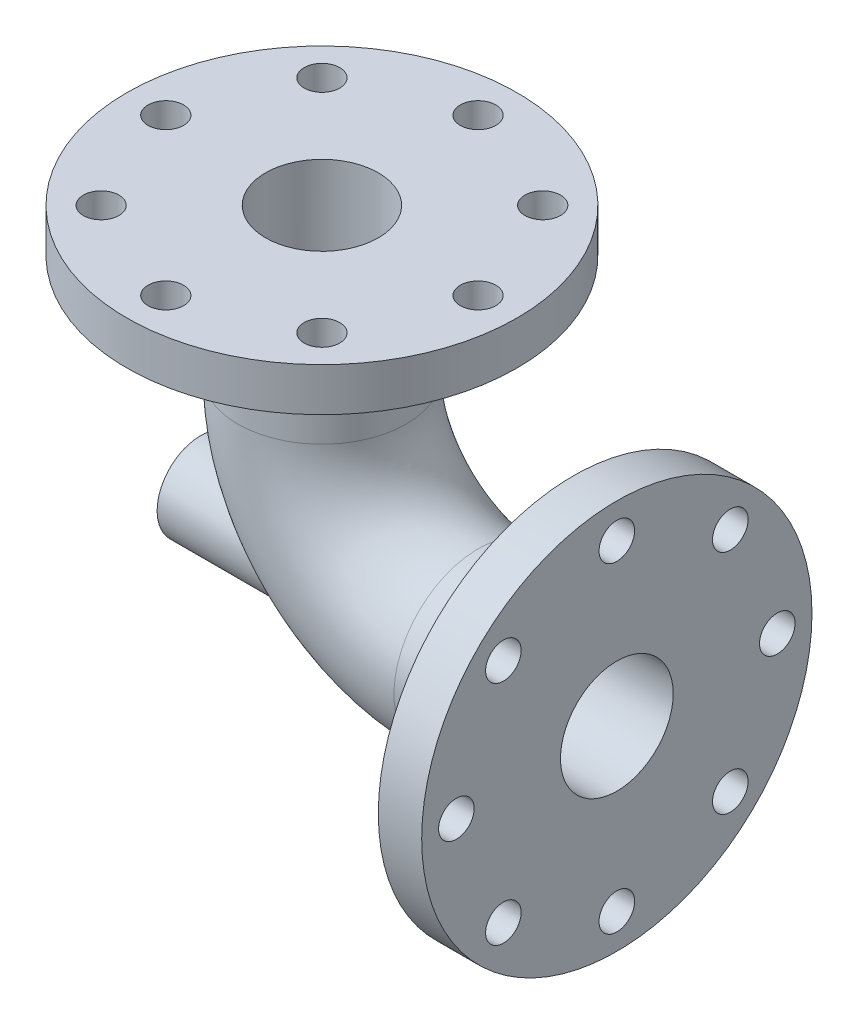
ISO-10303-21;
HEADER;
FILE_DESCRIPTION(('STEP AP214'),'2;1');
FILE_NAME('part.step','',(''),(''),'','','');
FILE_SCHEMA(('AUTOMOTIVE_DESIGN { 1 0 10303 214 1 1 1 1 }'));
ENDSEC;
DATA;
#1=APPLICATION_CONTEXT('core data for automotive mechanical design processes');
#2=APPLICATION_PROTOCOL_DEFINITION('international standard','automotive_design',2000,#1);
#3=PRODUCT_CONTEXT('',#1,'mechanical');
#4=PRODUCT('Part','Part','',(#3));
#5=PRODUCT_RELATED_PRODUCT_CATEGORY('part','',(#4));
#6=PRODUCT_DEFINITION_FORMATION('','',#4);
#7=PRODUCT_DEFINITION_CONTEXT('part definition',#1,'design');
#8=PRODUCT_DEFINITION('design','',#6,#7);
#9=PRODUCT_DEFINITION_SHAPE('','',#8);
#10=(LENGTH_UNIT() NAMED_UNIT(*) SI_UNIT(.MILLI.,.METRE.));
#11=(NAMED_UNIT(*) PLANE_ANGLE_UNIT() SI_UNIT($,.RADIAN.));
#12=(NAMED_UNIT(*) SI_UNIT($,.STERADIAN.) SOLID_ANGLE_UNIT());
#13=UNCERTAINTY_MEASURE_WITH_UNIT(LENGTH_MEASURE(1.E-05),#10,'distance_accuracy_value','');
#14=(GEOMETRIC_REPRESENTATION_CONTEXT(3) GLOBAL_UNCERTAINTY_ASSIGNED_CONTEXT((#13)) GLOBAL_UNIT_ASSIGNED_CONTEXT((#10,
#11,#12)) REPRESENTATION_CONTEXT('',''));
#15=CARTESIAN_POINT('',(0.,0.,0.));
#16=DIRECTION('',(0.,0.,1.));
#17=DIRECTION('',(1.,0.,0.));
#18=AXIS2_PLACEMENT_3D('',#15,#16,#17);
#19=CARTESIAN_POINT('',(0.,0.,0.));
#20=DIRECTION('',(0.,0.,-1.));
#21=DIRECTION('',(-1.,0.,0.));
#22=AXIS2_PLACEMENT_3D('',#19,#20,#21);
#23=TOROIDAL_SURFACE('',#22,90.,48.5);
#24=CARTESIAN_POINT('',(-90.,0.,0.));
#25=DIRECTION('',(0.,-1.,0.));
#26=DIRECTION('',(0.,0.,-1.));
#27=AXIS2_PLACEMENT_3D('',#24,#25,#26);
#28=CIRCLE('',#27,48.5);
#29=CARTESIAN_POINT('',(-90.,0.,-48.5));
#30=VERTEX_POINT('',#29);
#31=EDGE_CURVE('E44',#30,#30,#28,.T.);
#32=ORIENTED_EDGE('',*,*,#31,.T.);
#33=EDGE_LOOP('',(#32));
#34=FACE_BOUND('',#33,.T.);
#35=CARTESIAN_POINT('',(0.,-90.,0.));
#36=DIRECTION('',(1.,0.,0.));
#37=DIRECTION('',(0.,0.,-1.));
#38=AXIS2_PLACEMENT_3D('',#35,#36,#37);
#39=CIRCLE('',#38,48.5);
#40=CARTESIAN_POINT('',(0.,-90.,-48.5));
#41=VERTEX_POINT('',#40);
#42=EDGE_CURVE('E48',#41,#41,#39,.T.);
#43=ORIENTED_EDGE('',*,*,#42,.F.);
#44=EDGE_LOOP('',(#43));
#45=FACE_BOUND('',#44,.T.);
#46=CARTESIAN_POINT('',(-89.8449299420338,-96.875919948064,-24.035842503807));
#47=CARTESIAN_POINT('',(-89.2825330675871,-97.5468685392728,-23.8439036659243));
#48=CARTESIAN_POINT('',(-88.7304253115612,-98.2179177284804,-23.621553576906));
#49=CARTESIAN_POINT('',(-87.6507002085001,-99.5556563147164,-23.1128027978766));
#50=CARTESIAN_POINT('',(-87.1230864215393,-100.222345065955,-22.8263928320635));
#51=CARTESIAN_POINT('',(-86.0965582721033,-101.545396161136,-22.186554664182));
#52=CARTESIAN_POINT('',(-85.5976305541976,-102.201763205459,-21.8331579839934));
#53=CARTESIAN_POINT('',(-84.8738989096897,-103.173123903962,-21.2511488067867));
#54=CARTESIAN_POINT('',(-84.6367783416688,-103.494693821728,-21.048506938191));
#55=CARTESIAN_POINT('',(-84.1711191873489,-104.132603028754,-20.6256153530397));
#56=CARTESIAN_POINT('',(-83.9425828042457,-104.448940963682,-20.4053611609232));
#57=CARTESIAN_POINT('',(-83.3555767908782,-105.269697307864,-19.804842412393));
#58=CARTESIAN_POINT('',(-83.0045200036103,-105.768962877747,-19.4101271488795));
#59=CARTESIAN_POINT('',(-82.328599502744,-106.745583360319,-18.5741364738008));
#60=CARTESIAN_POINT('',(-82.0037307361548,-107.222942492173,-18.1328700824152));
#61=CARTESIAN_POINT('',(-81.3820615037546,-108.150413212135,-17.2044431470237));
#62=CARTESIAN_POINT('',(-81.0852548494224,-108.600530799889,-16.7172927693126));
#63=CARTESIAN_POINT('',(-80.5213707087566,-109.468010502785,-15.6985392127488));
#64=CARTESIAN_POINT('',(-80.2542937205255,-109.885372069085,-15.1669352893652));
#65=CARTESIAN_POINT('',(-79.7498574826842,-110.684098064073,-14.0583638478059));
#66=CARTESIAN_POINT('',(-79.5126893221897,-111.065227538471,-13.4811395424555));
#67=CARTESIAN_POINT('',(-79.0712894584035,-111.782983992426,-12.2876549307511));
#68=CARTESIAN_POINT('',(-78.8670584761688,-112.119609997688,-11.6713937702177));
#69=CARTESIAN_POINT('',(-78.4926410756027,-112.743040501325,-10.4044434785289));
#70=CARTESIAN_POINT('',(-78.3224466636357,-113.029856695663,-9.75376247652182));
#71=CARTESIAN_POINT('',(-78.0168742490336,-113.549091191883,-8.42319034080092));
#72=CARTESIAN_POINT('',(-77.8814922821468,-113.781515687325,-7.74330254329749));
#73=CARTESIAN_POINT('',(-77.6586541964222,-114.166479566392,-6.43398877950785));
#74=CARTESIAN_POINT('',(-77.5676323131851,-114.324886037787,-5.80688626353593));
#75=CARTESIAN_POINT('',(-77.4141521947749,-114.593042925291,-4.53894506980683));
#76=CARTESIAN_POINT('',(-77.3516918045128,-114.702797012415,-3.89810743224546));
#77=CARTESIAN_POINT('',(-77.2555422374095,-114.872111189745,-2.60792644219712));
#78=CARTESIAN_POINT('',(-77.2218432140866,-114.931688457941,-1.95858607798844));
#79=CARTESIAN_POINT('',(-77.18328099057,-114.999884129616,-0.656382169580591));
#80=CARTESIAN_POINT('',(-77.1784170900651,-115.00850377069,-0.00351871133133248));
#81=CARTESIAN_POINT('',(-77.1970068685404,-114.975609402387,1.26436086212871));
#82=CARTESIAN_POINT('',(-77.2189093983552,-114.936841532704,1.87947334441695));
#83=CARTESIAN_POINT('',(-77.2883974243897,-114.814218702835,3.10369888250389));
#84=CARTESIAN_POINT('',(-77.3359816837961,-114.730365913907,3.71281222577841));
#85=CARTESIAN_POINT('',(-77.4566949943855,-114.518622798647,4.92067552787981));
#86=CARTESIAN_POINT('',(-77.5298208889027,-114.390737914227,5.51942675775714));
#87=CARTESIAN_POINT('',(-77.7014100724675,-114.092490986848,6.70254179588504));
#88=CARTESIAN_POINT('',(-77.7998737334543,-113.922128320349,7.28690539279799));
#89=CARTESIAN_POINT('',(-78.0219992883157,-113.540702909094,8.4382226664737));
#90=CARTESIAN_POINT('',(-78.1456974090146,-113.3295816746,9.00514994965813));
#91=CARTESIAN_POINT('',(-78.4177997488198,-112.869297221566,10.1171822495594));
#92=CARTESIAN_POINT('',(-78.5662037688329,-112.620134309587,10.6622874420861));
#93=CARTESIAN_POINT('',(-78.8872148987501,-112.086610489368,11.7275979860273));
#94=CARTESIAN_POINT('',(-79.0598236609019,-111.802247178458,12.247801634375));
#95=CARTESIAN_POINT('',(-79.4286014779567,-111.201485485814,13.2606082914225));
#96=CARTESIAN_POINT('',(-79.6247712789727,-110.885086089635,13.7532104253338));
#97=CARTESIAN_POINT('',(-80.0506281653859,-110.206525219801,14.7332842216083));
#98=CARTESIAN_POINT('',(-80.2815225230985,-109.84284476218,15.2191791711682));
#99=CARTESIAN_POINT('',(-80.7674875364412,-109.087789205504,16.1560616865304));
#100=CARTESIAN_POINT('',(-81.0225588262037,-108.6964133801,16.6070483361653));
#101=CARTESIAN_POINT('',(-81.5557232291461,-107.889965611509,17.4728118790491));
#102=CARTESIAN_POINT('',(-81.8338186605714,-107.474891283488,17.8875851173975));
#103=CARTESIAN_POINT('',(-82.4117279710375,-106.624980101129,18.680143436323));
#104=CARTESIAN_POINT('',(-82.7115446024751,-106.190140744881,19.0579238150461));
#105=CARTESIAN_POINT('',(-83.3663653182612,-105.254621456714,19.8166313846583));
#106=CARTESIAN_POINT('',(-83.7237831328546,-104.752038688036,20.1931292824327));
#107=CARTESIAN_POINT('',(-84.4616847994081,-103.731847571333,20.9002792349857));
#108=CARTESIAN_POINT('',(-84.8421697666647,-103.214238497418,21.2309290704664));
#109=CARTESIAN_POINT('',(-85.6242935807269,-102.167970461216,21.8474119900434));
#110=CARTESIAN_POINT('',(-86.0259438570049,-101.639305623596,22.1332205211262));
#111=CARTESIAN_POINT('',(-86.8481657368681,-100.574784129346,22.6611342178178));
#112=CARTESIAN_POINT('',(-87.2687409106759,-100.038926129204,22.9032310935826));
#113=CARTESIAN_POINT('',(-88.0215438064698,-99.0950176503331,23.2910591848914));
#114=CARTESIAN_POINT('',(-88.3501870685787,-98.6878015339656,23.4458710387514));
#115=CARTESIAN_POINT('',(-89.0160615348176,-97.8723336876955,23.7321102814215));
#116=CARTESIAN_POINT('',(-89.3532913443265,-97.4640821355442,23.8635414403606));
#117=CARTESIAN_POINT('',(-90.3769650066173,-96.2388170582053,24.2240039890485));
#118=CARTESIAN_POINT('',(-91.075234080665,-95.4214924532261,24.4191236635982));
#119=CARTESIAN_POINT('',(-92.4973777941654,-93.7915270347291,24.7247495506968));
#120=CARTESIAN_POINT('',(-93.2212904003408,-92.9788954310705,24.8351243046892));
#121=CARTESIAN_POINT('',(-94.6876879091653,-91.3637986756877,24.9759287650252));
#122=CARTESIAN_POINT('',(-95.4301709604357,-90.5613325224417,25.0063664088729));
#123=CARTESIAN_POINT('',(-96.9439834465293,-88.9526616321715,24.9912743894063));
#124=CARTESIAN_POINT('',(-97.7155908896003,-88.1467363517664,24.9441255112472));
#125=CARTESIAN_POINT('',(-99.2668088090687,-86.5507680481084,24.7739148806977));
#126=CARTESIAN_POINT('',(-100.046419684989,-85.7607258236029,24.6508493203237));
#127=CARTESIAN_POINT('',(-101.608315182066,-84.1983037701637,24.3305646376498));
#128=CARTESIAN_POINT('',(-102.390600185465,-83.4259265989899,24.1333344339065));
#129=CARTESIAN_POINT('',(-103.95225140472,-81.9008503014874,23.6651647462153));
#130=CARTESIAN_POINT('',(-104.731617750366,-81.1481502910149,23.3942285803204));
#131=CARTESIAN_POINT('',(-106.278537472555,-79.6676890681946,22.7790103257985));
#132=CARTESIAN_POINT('',(-107.046126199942,-78.9398381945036,22.4350337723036));
#133=CARTESIAN_POINT('',(-108.566567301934,-77.5087171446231,21.6708553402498));
#134=CARTESIAN_POINT('',(-109.319417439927,-76.8054506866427,21.2506419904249));
#135=CARTESIAN_POINT('',(-110.801945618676,-75.4286836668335,20.3312856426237));
#136=CARTESIAN_POINT('',(-111.531651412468,-74.7551470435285,19.8322418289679));
#137=CARTESIAN_POINT('',(-112.959739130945,-73.4429670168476,18.7506565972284));
#138=CARTESIAN_POINT('',(-113.658136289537,-72.8043066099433,18.1681563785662));
#139=CARTESIAN_POINT('',(-114.776704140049,-71.7848842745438,17.1329552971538));
#140=CARTESIAN_POINT('',(-115.209129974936,-71.3917081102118,16.7056127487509));
#141=CARTESIAN_POINT('',(-116.052136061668,-70.6266106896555,15.8119500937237));
#142=CARTESIAN_POINT('',(-116.462717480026,-70.2546882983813,15.3456320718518));
#143=CARTESIAN_POINT('',(-117.256988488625,-69.5362369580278,14.3735588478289));
#144=CARTESIAN_POINT('',(-117.640713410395,-69.1896746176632,13.8678573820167));
#145=CARTESIAN_POINT('',(-118.376703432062,-68.5256972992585,12.815662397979));
#146=CARTESIAN_POINT('',(-118.728965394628,-68.2082852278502,12.2691648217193));
#147=CARTESIAN_POINT('',(-119.323014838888,-67.6734465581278,11.2594986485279));
#148=CARTESIAN_POINT('',(-119.572131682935,-67.4493195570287,10.8041833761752));
#149=CARTESIAN_POINT('',(-120.044050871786,-67.0249544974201,9.86967154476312));
#150=CARTESIAN_POINT('',(-120.266867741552,-66.8247032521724,9.39048837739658));
#151=CARTESIAN_POINT('',(-120.682901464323,-66.450944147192,8.40936763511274));
#152=CARTESIAN_POINT('',(-120.876121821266,-66.2774331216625,7.90743276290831));
#153=CARTESIAN_POINT('',(-121.229529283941,-65.9601608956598,6.88285373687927));
#154=CARTESIAN_POINT('',(-121.389716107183,-65.816399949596,6.36020940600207));
#155=CARTESIAN_POINT('',(-121.675149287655,-65.5602827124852,5.2919594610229));
#156=CARTESIAN_POINT('',(-121.800030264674,-65.4482548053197,4.74617651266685));
#157=CARTESIAN_POINT('',(-122.009707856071,-65.260178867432,3.64080679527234));
#158=CARTESIAN_POINT('',(-122.094504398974,-65.1841309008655,3.08122000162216));
#159=CARTESIAN_POINT('',(-122.221733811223,-65.0700338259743,1.95384436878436));
#160=CARTESIAN_POINT('',(-122.264200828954,-65.031954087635,1.38606251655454));
#161=CARTESIAN_POINT('',(-122.305697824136,-64.9947440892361,0.247677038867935));
#162=CARTESIAN_POINT('',(-122.304734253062,-64.9956080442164,-0.322926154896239));
#163=CARTESIAN_POINT('',(-122.262873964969,-65.0331439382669,-1.37464340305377));
#164=CARTESIAN_POINT('',(-122.228051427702,-65.0643691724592,-1.85621388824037));
#165=CARTESIAN_POINT('',(-122.127908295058,-65.1541742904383,-2.81353825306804));
#166=CARTESIAN_POINT('',(-122.062591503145,-65.2127507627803,-3.28929285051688));
#167=CARTESIAN_POINT('',(-121.902696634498,-65.3561629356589,-4.23185779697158));
#168=CARTESIAN_POINT('',(-121.808115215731,-65.4410016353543,-4.69866711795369));
#169=CARTESIAN_POINT('',(-121.591374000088,-65.6354502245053,-5.62055947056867));
#170=CARTESIAN_POINT('',(-121.469212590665,-65.745061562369,-6.07564181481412));
#171=CARTESIAN_POINT('',(-121.197566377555,-65.9888572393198,-6.97753560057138));
#172=CARTESIAN_POINT('',(-121.047753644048,-66.123336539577,-7.42416808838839));
#173=CARTESIAN_POINT('',(-120.724114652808,-66.4139404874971,-8.30128669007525));
#174=CARTESIAN_POINT('',(-120.550289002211,-66.5700645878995,-8.7317732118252));
#175=CARTESIAN_POINT('',(-119.996130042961,-67.0679852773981,-9.99720214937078));
#176=CARTESIAN_POINT('',(-119.583049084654,-67.4393891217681,-10.8063262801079));
#177=CARTESIAN_POINT('',(-118.423015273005,-68.4836581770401,-12.8048196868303));
#178=CARTESIAN_POINT('',(-117.622625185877,-69.2053193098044,-13.9378008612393));
#179=CARTESIAN_POINT('',(-116.332954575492,-70.3721724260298,-15.4975033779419));
#180=CARTESIAN_POINT('',(-115.887374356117,-70.7759502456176,-15.9948427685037));
#181=CARTESIAN_POINT('',(-114.971382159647,-71.6077886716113,-16.9447519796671));
#182=CARTESIAN_POINT('',(-114.500970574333,-72.0358488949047,-17.3973225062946));
#183=CARTESIAN_POINT('',(-113.670679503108,-72.7933896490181,-18.1420261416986));
#184=CARTESIAN_POINT('',(-113.315462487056,-73.1180842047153,-18.4443598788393));
#185=CARTESIAN_POINT('',(-112.595911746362,-73.777264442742,-19.0267230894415));
#186=CARTESIAN_POINT('',(-112.231577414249,-74.1117507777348,-19.3067510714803));
#187=CARTESIAN_POINT('',(-111.126750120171,-75.1286336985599,-20.1144870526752));
#188=CARTESIAN_POINT('',(-110.374556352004,-75.8243417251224,-20.6097376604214));
#189=CARTESIAN_POINT('',(-108.847730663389,-77.2457590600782,-21.5184064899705));
#190=CARTESIAN_POINT('',(-108.073070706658,-77.9715063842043,-21.931716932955));
#191=CARTESIAN_POINT('',(-106.509829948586,-79.4480112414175,-22.6790644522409));
#192=CARTESIAN_POINT('',(-105.721251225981,-80.1987650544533,-23.0131132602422));
#193=CARTESIAN_POINT('',(-104.107386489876,-81.7505320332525,-23.6149152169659));
#194=CARTESIAN_POINT('',(-103.281820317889,-82.5523773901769,-23.8797646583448));
#195=CARTESIAN_POINT('',(-101.629223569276,-84.1774831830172,-24.3271165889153));
#196=CARTESIAN_POINT('',(-100.802192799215,-85.0007466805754,-24.5096072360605));
#197=CARTESIAN_POINT('',(-99.1549972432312,-86.6645875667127,-24.7908324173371));
#198=CARTESIAN_POINT('',(-98.3348214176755,-87.5051232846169,-24.8897487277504));
#199=CARTESIAN_POINT('',(-96.7061053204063,-89.2027650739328,-25.0017535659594));
#200=CARTESIAN_POINT('',(-95.8975610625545,-90.059865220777,-25.0148722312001));
#201=CARTESIAN_POINT('',(-94.6452991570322,-91.4131242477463,-24.9648320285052));
#202=CARTESIAN_POINT('',(-94.1953011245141,-91.9047642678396,-24.9322603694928));
#203=CARTESIAN_POINT('',(-93.302486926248,-92.8916216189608,-24.8371547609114));
#204=CARTESIAN_POINT('',(-92.8596699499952,-93.386838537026,-24.7746242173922));
#205=CARTESIAN_POINT('',(-91.9822842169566,-94.3802493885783,-24.6184152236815));
#206=CARTESIAN_POINT('',(-91.547720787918,-94.8784449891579,-24.5247173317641));
#207=CARTESIAN_POINT('',(-90.6885106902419,-95.8763816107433,-24.3049222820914));
#208=CARTESIAN_POINT('',(-90.2638656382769,-96.3761228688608,-24.1788198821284));
#209=CARTESIAN_POINT('',(-89.8449299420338,-96.875919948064,-24.035842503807));
#210=B_SPLINE_CURVE_WITH_KNOTS('',3,(#46,#47,#48,#49,#50,#51,#52,#53,#54,#55,#56,#57,#58,#59,
#60,#61,#62,#63,#64,#65,#66,#67,#68,#69,#70,#71,#72,#73,#74,#75,#76,#77,#78,#79,#80,#81,#82,#83,
#84,#85,#86,#87,#88,#89,#90,#91,#92,#93,#94,#95,#96,#97,#98,#99,#100,#101,#102,#103,#104,#105,
#106,#107,#108,#109,#110,#111,#112,#113,#114,#115,#116,#117,#118,#119,#120,#121,#122,#123,#124,
#125,#126,#127,#128,#129,#130,#131,#132,#133,#134,#135,#136,#137,#138,#139,#140,#141,#142,#143,
#144,#145,#146,#147,#148,#149,#150,#151,#152,#153,#154,#155,#156,#157,#158,#159,#160,#161,#162,
#163,#164,#165,#166,#167,#168,#169,#170,#171,#172,#173,#174,#175,#176,#177,#178,#179,#180,#181,
#182,#183,#184,#185,#186,#187,#188,#189,#190,#191,#192,#193,#194,#195,#196,#197,#198,#199,#200,
#201,#202,#203,#204,#205,#206,#207,#208,#209),.UNSPECIFIED.,.T.,.F.,(4,2,2,2,2,2,2,2,2,2,2,2,2,
2,2,2,2,2,2,2,2,2,2,2,2,2,2,2,2,2,2,2,2,2,2,2,2,2,2,2,2,2,2,2,2,2,2,2,2,2,2,2,2,2,2,2,2,2,2,2,2,
2,2,2,2,2,2,2,2,2,2,2,2,2,2,2,2,2,2,2,2,4),(0.,2.68836013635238,5.3771097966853,8.064597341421,
9.40818183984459,10.75210885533,12.9303384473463,15.1081467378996,17.2854736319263,
19.4628370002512,21.6534738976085,23.8441587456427,26.0343284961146,28.2242487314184,
30.1812636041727,32.1381307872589,34.0943277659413,36.0504772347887,37.8984473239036,
39.7463284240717,41.5939812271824,43.4416611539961,45.2920125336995,47.1423490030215,
48.9928118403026,50.8433332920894,52.789354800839,54.7354273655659,56.6816961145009,
58.6282119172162,60.7937589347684,62.9594107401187,65.1262442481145,67.293488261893,
68.9300418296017,70.5663312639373,73.8397097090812,77.1181557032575,80.3962761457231,
83.7436817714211,87.0912553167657,90.4393292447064,93.7872524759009,97.1214375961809,
100.456124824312,103.786649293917,107.115535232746,109.286145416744,111.456639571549,
113.624222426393,115.792021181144,117.486578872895,119.180196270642,120.873613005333,
122.567044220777,124.277407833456,125.987774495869,127.696760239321,129.405492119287,
130.855258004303,132.304843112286,133.75459382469,135.204429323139,136.672715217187,
138.140963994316,141.07677831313,145.73999390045,148.07965349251,150.419276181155,
152.123742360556,153.828322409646,157.238079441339,160.652292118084,164.06599913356,
167.605767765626,171.146045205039,174.678602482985,178.209918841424,180.211161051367,
182.212175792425,184.214441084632,186.217030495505),.UNSPECIFIED.);
#211=CARTESIAN_POINT('',(-89.8449299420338,-96.875919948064,-24.035842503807));
#212=VERTEX_POINT('',#211);
#213=EDGE_CURVE('E10',#212,#212,#210,.T.);
#214=ORIENTED_EDGE('',*,*,#213,.F.);
#215=EDGE_LOOP('',(#214));
#216=FACE_BOUND('',#215,.T.);
#217=ADVANCED_FACE('F30',(#34,#45,#216),#23,.T.);
#218=CARTESIAN_POINT('',(-90.,0.,0.));
#219=DIRECTION('',(0.,1.,0.));
#220=DIRECTION('',(0.,0.,1.));
#221=AXIS2_PLACEMENT_3D('',#218,#219,#220);
#222=CYLINDRICAL_SURFACE('',#221,48.5);
#223=ORIENTED_EDGE('',*,*,#31,.F.);
#224=EDGE_LOOP('',(#223));
#225=FACE_BOUND('',#224,.T.);
#226=CARTESIAN_POINT('',(-90.,60.,0.));
#227=DIRECTION('',(0.,1.,0.));
#228=DIRECTION('',(-1.,0.,0.));
#229=AXIS2_PLACEMENT_3D('',#226,#227,#228);
#230=CIRCLE('',#229,48.5);
#231=CARTESIAN_POINT('',(-138.5,60.,0.));
#232=VERTEX_POINT('',#231);
#233=EDGE_CURVE('E40',#232,#232,#230,.T.);
#234=ORIENTED_EDGE('',*,*,#233,.F.);
#235=EDGE_LOOP('',(#234));
#236=FACE_BOUND('',#235,.T.);
#237=ADVANCED_FACE('F32',(#225,#236),#222,.T.);
#238=CARTESIAN_POINT('',(0.,-90.,0.));
#239=DIRECTION('',(1.,0.,0.));
#240=DIRECTION('',(0.,0.,-1.));
#241=AXIS2_PLACEMENT_3D('',#238,#239,#240);
#242=CYLINDRICAL_SURFACE('',#241,48.5);
#243=ORIENTED_EDGE('',*,*,#42,.T.);
#244=EDGE_LOOP('',(#243));
#245=FACE_BOUND('',#244,.T.);
#246=CARTESIAN_POINT('',(55.,-90.,0.));
#247=DIRECTION('',(1.,0.,0.));
#248=DIRECTION('',(0.,0.,-1.));
#249=AXIS2_PLACEMENT_3D('',#246,#247,#248);
#250=CIRCLE('',#249,48.5);
#251=CARTESIAN_POINT('',(55.,-90.,-48.5));
#252=VERTEX_POINT('',#251);
#253=EDGE_CURVE('E51',#252,#252,#250,.T.);
#254=ORIENTED_EDGE('',*,*,#253,.F.);
#255=EDGE_LOOP('',(#254));
#256=FACE_BOUND('',#255,.T.);
#257=ADVANCED_FACE('F213',(#245,#256),#242,.T.);
#258=CARTESIAN_POINT('',(-90.,85.,0.));
#259=DIRECTION('',(0.,-1.,0.));
#260=DIRECTION('',(0.,0.,-1.));
#261=AXIS2_PLACEMENT_3D('',#258,#259,#260);
#262=PLANE('',#261);
#263=CARTESIAN_POINT('',(-26.36038969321,85.,63.6396103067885));
#264=DIRECTION('',(0.,1.,0.));
#265=DIRECTION('',(-0.707106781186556,0.,-0.707106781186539));
#266=AXIS2_PLACEMENT_3D('',#263,#264,#265);
#267=CIRCLE('',#266,10.25);
#268=CARTESIAN_POINT('',(-33.6082342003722,85.,56.3917657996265));
#269=VERTEX_POINT('',#268);
#270=EDGE_CURVE('E116',#269,#269,#267,.T.);
#271=ORIENTED_EDGE('',*,*,#270,.F.);
#272=EDGE_LOOP('',(#271));
#273=FACE_BOUND('',#272,.T.);
#274=CARTESIAN_POINT('',(-89.999999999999,85.,90.));
#275=DIRECTION('',(0.,1.,0.));
#276=DIRECTION('',(0.,0.,-1.));
#277=AXIS2_PLACEMENT_3D('',#274,#275,#276);
#278=CIRCLE('',#277,10.25);
#279=CARTESIAN_POINT('',(-89.9999999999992,85.,79.75));
#280=VERTEX_POINT('',#279);
#281=EDGE_CURVE('E110',#280,#280,#278,.T.);
#282=ORIENTED_EDGE('',*,*,#281,.F.);
#283=EDGE_LOOP('',(#282));
#284=FACE_BOUND('',#283,.T.);
#285=CARTESIAN_POINT('',(-153.639610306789,85.,63.6396103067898));
#286=DIRECTION('',(0.,1.,0.));
#287=DIRECTION('',(0.707106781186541,0.,-0.707106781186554));
#288=AXIS2_PLACEMENT_3D('',#285,#286,#287);
#289=CIRCLE('',#288,10.25);
#290=CARTESIAN_POINT('',(-146.391765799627,85.,56.3917657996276));
#291=VERTEX_POINT('',#290);
#292=EDGE_CURVE('E104',#291,#291,#289,.T.);
#293=ORIENTED_EDGE('',*,*,#292,.F.);
#294=EDGE_LOOP('',(#293));
#295=FACE_BOUND('',#294,.T.);
#296=CARTESIAN_POINT('',(-180.,85.,0.));
#297=DIRECTION('',(0.,1.,0.));
#298=DIRECTION('',(1.,0.,0.));
#299=AXIS2_PLACEMENT_3D('',#296,#297,#298);
#300=CIRCLE('',#299,10.25);
#301=CARTESIAN_POINT('',(-169.75,85.,0.));
#302=VERTEX_POINT('',#301);
#303=EDGE_CURVE('E98',#302,#302,#300,.T.);
#304=ORIENTED_EDGE('',*,*,#303,.F.);
#305=EDGE_LOOP('',(#304));
#306=FACE_BOUND('',#305,.T.);
#307=CARTESIAN_POINT('',(-153.63961030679,85.,-63.6396103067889));
#308=DIRECTION('',(0.,1.,0.));
#309=DIRECTION('',(0.707106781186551,0.,0.707106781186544));
#310=AXIS2_PLACEMENT_3D('',#307,#308,#309);
#311=CIRCLE('',#310,10.25);
#312=CARTESIAN_POINT('',(-146.391765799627,85.,-56.3917657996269));
#313=VERTEX_POINT('',#312);
#314=EDGE_CURVE('E92',#313,#313,#311,.T.);
#315=ORIENTED_EDGE('',*,*,#314,.F.);
#316=EDGE_LOOP('',(#315));
#317=FACE_BOUND('',#316,.T.);
#318=CARTESIAN_POINT('',(-90.0000000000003,85.,-90.));
#319=DIRECTION('',(0.,1.,0.));
#320=DIRECTION('',(0.,0.,1.));
#321=AXIS2_PLACEMENT_3D('',#318,#319,#320);
#322=CIRCLE('',#321,10.25);
#323=CARTESIAN_POINT('',(-90.0000000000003,85.,-79.75));
#324=VERTEX_POINT('',#323);
#325=EDGE_CURVE('E86',#324,#324,#322,.T.);
#326=ORIENTED_EDGE('',*,*,#325,.F.);
#327=EDGE_LOOP('',(#326));
#328=FACE_BOUND('',#327,.T.);
#329=CARTESIAN_POINT('',(-26.3603896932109,85.,-63.6396103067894));
#330=DIRECTION('',(0.,1.,0.));
#331=DIRECTION('',(-0.707106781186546,0.,0.707106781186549));
#332=AXIS2_PLACEMENT_3D('',#329,#330,#331);
#333=CIRCLE('',#332,10.25);
#334=CARTESIAN_POINT('',(-33.608234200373,85.,-56.3917657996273));
#335=VERTEX_POINT('',#334);
#336=EDGE_CURVE('E80',#335,#335,#333,.T.);
#337=ORIENTED_EDGE('',*,*,#336,.F.);
#338=EDGE_LOOP('',(#337));
#339=FACE_BOUND('',#338,.T.);
#340=CARTESIAN_POINT('',(0.,85.,0.));
#341=DIRECTION('',(0.,1.,0.));
#342=DIRECTION('',(-1.,0.,0.));
#343=AXIS2_PLACEMENT_3D('',#340,#341,#342);
#344=CIRCLE('',#343,10.25);
#345=CARTESIAN_POINT('',(-10.25,85.,0.));
#346=VERTEX_POINT('',#345);
#347=EDGE_CURVE('E69',#346,#346,#344,.T.);
#348=ORIENTED_EDGE('',*,*,#347,.F.);
#349=EDGE_LOOP('',(#348));
#350=FACE_BOUND('',#349,.T.);
#351=CARTESIAN_POINT('',(-90.,85.,0.));
#352=DIRECTION('',(0.,-1.,0.));
#353=DIRECTION('',(1.,0.,0.));
#354=AXIS2_PLACEMENT_3D('',#351,#352,#353);
#355=CIRCLE('',#354,32.5);
#356=CARTESIAN_POINT('',(-57.5,85.,0.));
#357=VERTEX_POINT('',#356);
#358=EDGE_CURVE('E54',#357,#357,#355,.T.);
#359=ORIENTED_EDGE('',*,*,#358,.T.);
#360=EDGE_LOOP('',(#359));
#361=FACE_BOUND('',#360,.T.);
#362=CARTESIAN_POINT('',(-90.,85.,0.));
#363=DIRECTION('',(0.,1.,0.));
#364=DIRECTION('',(-1.,0.,0.));
#365=AXIS2_PLACEMENT_3D('',#362,#363,#364);
#366=CIRCLE('',#365,112.5);
#367=CARTESIAN_POINT('',(-202.5,85.,0.));
#368=VERTEX_POINT('',#367);
#369=EDGE_CURVE('E66',#368,#368,#366,.T.);
#370=ORIENTED_EDGE('',*,*,#369,.T.);
#371=EDGE_LOOP('',(#370));
#372=FACE_BOUND('',#371,.T.);
#373=ADVANCED_FACE('F220',(#273,#284,#295,#306,#317,#328,#339,#350,#361,#372),#262,.F.);
#374=CARTESIAN_POINT('',(-90.,0.,0.));
#375=DIRECTION('',(0.,1.,0.));
#376=DIRECTION('',(0.,0.,1.));
#377=AXIS2_PLACEMENT_3D('',#374,#375,#376);
#378=CYLINDRICAL_SURFACE('',#377,32.5);
#379=CARTESIAN_POINT('',(-90.,0.,0.));
#380=DIRECTION('',(0.,-1.,0.));
#381=DIRECTION('',(0.,0.,-1.));
#382=AXIS2_PLACEMENT_3D('',#379,#380,#381);
#383=CIRCLE('',#382,32.5);
#384=CARTESIAN_POINT('',(-90.,0.,-32.5));
#385=VERTEX_POINT('',#384);
#386=EDGE_CURVE('E59',#385,#385,#383,.T.);
#387=ORIENTED_EDGE('',*,*,#386,.T.);
#388=EDGE_LOOP('',(#387));
#389=FACE_BOUND('',#388,.T.);
#390=ORIENTED_EDGE('',*,*,#358,.F.);
#391=EDGE_LOOP('',(#390));
#392=FACE_BOUND('',#391,.T.);
#393=ADVANCED_FACE('F224',(#389,#392),#378,.F.);
#394=CARTESIAN_POINT('',(0.,0.,0.));
#395=DIRECTION('',(0.,0.,-1.));
#396=DIRECTION('',(-1.,0.,0.));
#397=AXIS2_PLACEMENT_3D('',#394,#395,#396);
#398=TOROIDAL_SURFACE('',#397,90.,32.5);
#399=CARTESIAN_POINT('',(-91.5550325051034,-80.9612495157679,-4.27796560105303));
#400=CARTESIAN_POINT('',(-91.7414521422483,-80.8131570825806,-3.96503310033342));
#401=CARTESIAN_POINT('',(-91.9124105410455,-80.677630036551,-3.63661544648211));
#402=CARTESIAN_POINT('',(-92.1389806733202,-80.4982489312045,-3.12246576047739));
#403=CARTESIAN_POINT('',(-92.2095625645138,-80.4424114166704,-2.947373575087));
#404=CARTESIAN_POINT('',(-92.3395862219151,-80.3396076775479,-2.59060529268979));
#405=CARTESIAN_POINT('',(-92.3990327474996,-80.2926376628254,-2.40893204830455));
#406=CARTESIAN_POINT('',(-92.5061390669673,-80.2080480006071,-2.03817298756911));
#407=CARTESIAN_POINT('',(-92.5536900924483,-80.1705146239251,-1.84903586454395));
#408=CARTESIAN_POINT('',(-92.6352659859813,-80.1061446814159,-1.46605566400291));
#409=CARTESIAN_POINT('',(-92.6692908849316,-80.0793080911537,-1.27221259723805));
#410=CARTESIAN_POINT('',(-92.7229532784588,-80.0369903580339,-0.881484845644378));
#411=CARTESIAN_POINT('',(-92.7426036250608,-80.0214990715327,-0.684603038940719));
#412=CARTESIAN_POINT('',(-92.7670474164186,-80.0022297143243,-0.289351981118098));
#413=CARTESIAN_POINT('',(-92.771842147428,-79.9984506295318,-0.0909828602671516));
#414=CARTESIAN_POINT('',(-92.7666868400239,-80.0025143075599,0.288188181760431));
#415=CARTESIAN_POINT('',(-92.7579811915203,-80.0093762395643,0.469019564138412));
#416=CARTESIAN_POINT('',(-92.7282806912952,-80.0327911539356,0.829024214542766));
#417=CARTESIAN_POINT('',(-92.7072865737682,-80.0493435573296,1.0081975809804));
#418=CARTESIAN_POINT('',(-92.6534540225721,-80.0917995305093,1.36367976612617));
#419=CARTESIAN_POINT('',(-92.6206116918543,-80.1177061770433,1.53998762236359));
#420=CARTESIAN_POINT('',(-92.5437465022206,-80.1783635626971,1.88858821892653));
#421=CARTESIAN_POINT('',(-92.4997231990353,-80.2131146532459,2.06088079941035));
#422=CARTESIAN_POINT('',(-92.4014727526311,-80.2907110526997,2.39996982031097));
#423=CARTESIAN_POINT('',(-92.3472815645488,-80.3335278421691,2.56678326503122));
#424=CARTESIAN_POINT('',(-92.2294627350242,-80.4266736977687,2.89491566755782));
#425=CARTESIAN_POINT('',(-92.1658321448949,-80.4770051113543,3.05623288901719));
#426=CARTESIAN_POINT('',(-91.9621636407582,-80.6382181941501,3.53110792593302));
#427=CARTESIAN_POINT('',(-91.8093037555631,-80.7593543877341,3.83574073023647));
#428=CARTESIAN_POINT('',(-91.3697772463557,-81.1083098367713,4.60585715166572));
#429=CARTESIAN_POINT('',(-91.0600288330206,-81.3548333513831,5.0497185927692));
#430=CARTESIAN_POINT('',(-90.5587822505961,-81.7553747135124,5.66447943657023));
#431=CARTESIAN_POINT('',(-90.3852506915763,-81.8942922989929,5.8612021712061));
#432=CARTESIAN_POINT('',(-90.0279841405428,-82.1809099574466,6.23841835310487));
#433=CARTESIAN_POINT('',(-89.8442494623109,-82.3286097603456,6.41891229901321));
#434=CARTESIAN_POINT('',(-89.3667849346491,-82.7133411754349,6.85784635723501));
#435=CARTESIAN_POINT('',(-89.0673390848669,-82.9554598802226,7.10560740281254));
#436=CARTESIAN_POINT('',(-88.453919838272,-83.4535291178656,7.56696633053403));
#437=CARTESIAN_POINT('',(-88.1399387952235,-83.7094869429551,7.78054596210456));
#438=CARTESIAN_POINT('',(-87.5009220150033,-84.2328730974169,8.17606140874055));
#439=CARTESIAN_POINT('',(-87.1758706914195,-84.5003177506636,8.35795019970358));
#440=CARTESIAN_POINT('',(-86.5181570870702,-85.0443117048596,8.691543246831));
#441=CARTESIAN_POINT('',(-86.1854953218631,-85.3208603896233,8.84324954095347));
#442=CARTESIAN_POINT('',(-85.3921827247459,-85.9841801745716,9.1681571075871));
#443=CARTESIAN_POINT('',(-84.9292031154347,-86.3742846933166,9.32893988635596));
#444=CARTESIAN_POINT('',(-83.9979576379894,-87.1659972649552,9.59913563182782));
#445=CARTESIAN_POINT('',(-83.5296897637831,-87.5676097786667,9.70852838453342));
#446=CARTESIAN_POINT('',(-82.591857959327,-88.3800148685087,9.8766255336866));
#447=CARTESIAN_POINT('',(-82.1222937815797,-88.7908093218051,9.93531946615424));
#448=CARTESIAN_POINT('',(-81.1857480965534,-89.6192190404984,10.0013801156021));
#449=CARTESIAN_POINT('',(-80.718765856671,-90.0368322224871,10.0087622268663));
#450=CARTESIAN_POINT('',(-79.8719324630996,-90.8032874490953,9.97371978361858));
#451=CARTESIAN_POINT('',(-79.4910836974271,-91.151426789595,9.93975362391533));
#452=CARTESIAN_POINT('',(-78.7358576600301,-91.8491099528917,9.8338848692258));
#453=CARTESIAN_POINT('',(-78.3614806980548,-92.1986538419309,9.76198046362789));
#454=CARTESIAN_POINT('',(-77.622498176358,-92.89632442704,9.57816422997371));
#455=CARTESIAN_POINT('',(-77.2578769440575,-93.2444525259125,9.46632130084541));
#456=CARTESIAN_POINT('',(-76.540904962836,-93.9369366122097,9.19989551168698));
#457=CARTESIAN_POINT('',(-76.1885493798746,-94.2812940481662,9.04532970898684));
#458=CARTESIAN_POINT('',(-75.6058395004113,-94.8575254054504,8.7450035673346));
#459=CARTESIAN_POINT('',(-75.3712999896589,-95.0914134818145,8.61116232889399));
#460=CARTESIAN_POINT('',(-74.9113667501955,-95.5538590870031,8.32041089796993));
#461=CARTESIAN_POINT('',(-74.685972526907,-95.7824169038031,8.1635019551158));
#462=CARTESIAN_POINT('',(-74.2463207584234,-96.231900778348,7.8257497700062));
#463=CARTESIAN_POINT('',(-74.0320515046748,-96.4528347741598,7.64493243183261));
#464=CARTESIAN_POINT('',(-73.6163664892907,-96.8848915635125,7.25825703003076));
#465=CARTESIAN_POINT('',(-73.4149521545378,-97.0960132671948,7.05239619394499));
#466=CARTESIAN_POINT('',(-73.0703670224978,-97.4599873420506,6.66355261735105));
#467=CARTESIAN_POINT('',(-72.9241819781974,-97.6153827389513,6.48561307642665));
#468=CARTESIAN_POINT('',(-72.6423167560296,-97.9167288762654,6.11412933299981));
#469=CARTESIAN_POINT('',(-72.506634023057,-98.0626819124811,5.92058894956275));
#470=CARTESIAN_POINT('',(-72.2472006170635,-98.3432541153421,5.51817248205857));
#471=CARTESIAN_POINT('',(-72.1234405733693,-98.4778821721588,5.309308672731));
#472=CARTESIAN_POINT('',(-71.8891830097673,-98.7339622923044,4.87658402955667));
#473=CARTESIAN_POINT('',(-71.7786833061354,-98.8554165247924,4.6527256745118));
#474=CARTESIAN_POINT('',(-71.5897596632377,-99.0639704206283,4.22969713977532));
#475=CARTESIAN_POINT('',(-71.5090653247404,-99.1534142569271,4.0326933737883));
#476=CARTESIAN_POINT('',(-71.3587499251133,-99.3205599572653,3.62970029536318));
#477=CARTESIAN_POINT('',(-71.2891267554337,-99.3982640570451,3.42371270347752));
#478=CARTESIAN_POINT('',(-71.1617786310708,-99.5407741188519,3.00379326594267));
#479=CARTESIAN_POINT('',(-71.104050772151,-99.6055832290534,2.78986337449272));
#480=CARTESIAN_POINT('',(-71.0012175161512,-99.7212748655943,2.35528542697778));
#481=CARTESIAN_POINT('',(-70.9561123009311,-99.7721571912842,2.1346372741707));
#482=CARTESIAN_POINT('',(-70.8789697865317,-99.8593111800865,1.68707055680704));
#483=CARTESIAN_POINT('',(-70.8469969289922,-99.8955107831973,1.46012677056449));
#484=CARTESIAN_POINT('',(-70.7969136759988,-99.9522637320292,1.00276721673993));
#485=CARTESIAN_POINT('',(-70.7788033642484,-99.9728169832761,0.772351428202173));
#486=CARTESIAN_POINT('',(-70.7567291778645,-99.9978735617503,0.310015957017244));
#487=CARTESIAN_POINT('',(-70.7527625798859,-100.002379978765,0.0780965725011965));
#488=CARTESIAN_POINT('',(-70.7590321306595,-99.9952606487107,-0.3852924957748));
#489=CARTESIAN_POINT('',(-70.7692674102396,-99.9836358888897,-0.616762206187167));
#490=CARTESIAN_POINT('',(-70.8023603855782,-99.9460942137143,-1.05841333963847));
#491=CARTESIAN_POINT('',(-70.8241158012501,-99.9214256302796,-1.26878583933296));
#492=CARTESIAN_POINT('',(-70.8791733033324,-99.859094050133,-1.68604768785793));
#493=CARTESIAN_POINT('',(-70.9124746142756,-99.8214319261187,-1.89293726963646));
#494=CARTESIAN_POINT('',(-70.990203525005,-99.7337077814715,-2.30188227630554));
#495=CARTESIAN_POINT('',(-71.0346288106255,-99.6836483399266,-2.50393869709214));
#496=CARTESIAN_POINT('',(-71.1341078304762,-99.5718402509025,-2.90218367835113));
#497=CARTESIAN_POINT('',(-71.1891655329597,-99.510087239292,-3.09837001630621));
#498=CARTESIAN_POINT('',(-71.3113553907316,-99.3734492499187,-3.49041578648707));
#499=CARTESIAN_POINT('',(-71.3788357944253,-99.2981877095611,-3.68603506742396));
#500=CARTESIAN_POINT('',(-71.5238232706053,-99.1370515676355,-4.06908922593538));
#501=CARTESIAN_POINT('',(-71.6013342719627,-99.0511728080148,-4.25652085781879));
#502=CARTESIAN_POINT('',(-71.7656278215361,-98.8698509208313,-4.62249420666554));
#503=CARTESIAN_POINT('',(-71.8524113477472,-98.7744067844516,-4.80103498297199));
#504=CARTESIAN_POINT('',(-72.0345044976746,-98.5749826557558,-5.14877335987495));
#505=CARTESIAN_POINT('',(-72.1298158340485,-98.4710009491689,-5.31796907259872));
#506=CARTESIAN_POINT('',(-72.3718788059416,-98.2080990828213,-5.71901765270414));
#507=CARTESIAN_POINT('',(-72.5228214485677,-98.0451260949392,-5.94570877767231));
#508=CARTESIAN_POINT('',(-72.8388177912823,-97.7063179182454,-6.37873893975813));
#509=CARTESIAN_POINT('',(-73.0038762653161,-97.5304783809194,-6.58507104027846));
#510=CARTESIAN_POINT('',(-73.3464848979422,-97.1681353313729,-6.97777361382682));
#511=CARTESIAN_POINT('',(-73.5240550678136,-96.981614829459,-7.16411084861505));
#512=CARTESIAN_POINT('',(-73.8897485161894,-96.6003423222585,-7.51684415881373));
#513=CARTESIAN_POINT('',(-74.077872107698,-96.4055900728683,-7.68323964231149));
#514=CARTESIAN_POINT('',(-74.5356724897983,-95.9352277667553,-8.0556685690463));
#515=CARTESIAN_POINT('',(-74.8094227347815,-95.6567423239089,-8.25308956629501));
#516=CARTESIAN_POINT('',(-75.3708606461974,-95.0915363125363,-8.61328249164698));
#517=CARTESIAN_POINT('',(-75.6585533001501,-94.804812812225,-8.77604190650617));
#518=CARTESIAN_POINT('',(-76.2454099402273,-94.2259136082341,-9.06901288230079));
#519=CARTESIAN_POINT('',(-76.5445857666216,-93.9337324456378,-9.19918974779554));
#520=CARTESIAN_POINT('',(-77.1518087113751,-93.3466011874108,-9.4286588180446));
#521=CARTESIAN_POINT('',(-77.4598558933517,-93.0516510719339,-9.52795080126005));
#522=CARTESIAN_POINT('',(-78.1948580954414,-92.3546398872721,-9.72780773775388));
#523=CARTESIAN_POINT('',(-78.6247891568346,-91.9521501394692,-9.81602568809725));
#524=CARTESIAN_POINT('',(-79.4935251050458,-91.1487877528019,-9.94211653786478));
#525=CARTESIAN_POINT('',(-79.9323331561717,-90.7479157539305,-9.97997115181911));
#526=CARTESIAN_POINT('',(-80.8159602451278,-89.9497877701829,-10.0078553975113));
#527=CARTESIAN_POINT('',(-81.2607878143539,-89.5525386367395,-9.99780802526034));
#528=CARTESIAN_POINT('',(-82.1524823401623,-88.7644498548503,-9.93125297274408));
#529=CARTESIAN_POINT('',(-82.5993489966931,-88.3736092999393,-9.87475192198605));
#530=CARTESIAN_POINT('',(-83.4996234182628,-87.593572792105,-9.71443961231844));
#531=CARTESIAN_POINT('',(-83.9530135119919,-87.2045172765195,-9.6098418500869));
#532=CARTESIAN_POINT('',(-84.8552334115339,-86.4368994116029,-9.35244752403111));
#533=CARTESIAN_POINT('',(-85.3040618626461,-86.0583401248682,-9.19963705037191));
#534=CARTESIAN_POINT('',(-86.1923259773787,-85.3147690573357,-8.84410854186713));
#535=CARTESIAN_POINT('',(-86.6317731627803,-84.9497401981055,-8.64145607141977));
#536=CARTESIAN_POINT('',(-87.2798806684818,-84.41489402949,-8.29767416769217));
#537=CARTESIAN_POINT('',(-87.4940324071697,-84.2387608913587,-8.17647353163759));
#538=CARTESIAN_POINT('',(-87.9178395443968,-83.8912565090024,-7.92021908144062));
#539=CARTESIAN_POINT('',(-88.1274956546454,-83.7198845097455,-7.78516747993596));
#540=CARTESIAN_POINT('',(-88.5747577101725,-83.3553243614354,-7.47756652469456));
#541=CARTESIAN_POINT('',(-88.8114061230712,-83.1630853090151,-7.3024842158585));
#542=CARTESIAN_POINT('',(-89.2753177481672,-82.7873411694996,-6.93161160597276));
#543=CARTESIAN_POINT('',(-89.5025806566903,-82.6038363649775,-6.73582063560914));
#544=CARTESIAN_POINT('',(-89.9442288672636,-82.2481612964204,-6.32320025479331));
#545=CARTESIAN_POINT('',(-90.1586668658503,-82.0759443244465,-6.10646811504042));
#546=CARTESIAN_POINT('',(-90.5724704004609,-81.7443772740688,-5.65014733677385));
#547=CARTESIAN_POINT('',(-90.7718446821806,-81.5850197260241,-5.41057214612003));
#548=CARTESIAN_POINT('',(-91.1722773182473,-81.2655868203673,-4.88016784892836));
#549=CARTESIAN_POINT('',(-91.3711745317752,-81.1073069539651,-4.5865979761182));
#550=CARTESIAN_POINT('',(-91.5550325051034,-80.9612495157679,-4.27796560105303));
#551=B_SPLINE_CURVE_WITH_KNOTS('',3,(#399,#400,#401,#402,#403,#404,#405,#406,#407,#408,#409,
#410,#411,#412,#413,#414,#415,#416,#417,#418,#419,#420,#421,#422,#423,#424,#425,#426,#427,#428,
#429,#430,#431,#432,#433,#434,#435,#436,#437,#438,#439,#440,#441,#442,#443,#444,#445,#446,#447,
#448,#449,#450,#451,#452,#453,#454,#455,#456,#457,#458,#459,#460,#461,#462,#463,#464,#465,#466,
#467,#468,#469,#470,#471,#472,#473,#474,#475,#476,#477,#478,#479,#480,#481,#482,#483,#484,#485,
#486,#487,#488,#489,#490,#491,#492,#493,#494,#495,#496,#497,#498,#499,#500,#501,#502,#503,#504,
#505,#506,#507,#508,#509,#510,#511,#512,#513,#514,#515,#516,#517,#518,#519,#520,#521,#522,#523,
#524,#525,#526,#527,#528,#529,#530,#531,#532,#533,#534,#535,#536,#537,#538,#539,#540,#541,#542,
#543,#544,#545,#546,#547,#548,#549,#550),.UNSPECIFIED.,.T.,.F.,(4,2,2,2,2,2,2,2,2,2,2,2,2,2,2,2,
2,2,2,2,2,2,2,2,2,2,2,2,2,2,2,2,2,2,2,2,2,2,2,2,2,2,2,2,2,2,2,2,2,2,2,2,2,2,2,2,2,2,2,2,2,2,2,2,
2,2,2,2,2,2,2,2,2,2,2,4),(0.,1.17862321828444,1.76870836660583,2.35854072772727,
2.95358390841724,3.54862572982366,4.14313488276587,4.73759255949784,5.2804227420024,
5.82322049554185,6.36619694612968,6.90919497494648,7.45030788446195,7.99159018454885,
9.07367274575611,10.847290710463,11.7373078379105,12.6272976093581,13.9989295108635,
15.3712913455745,16.7456725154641,18.1199608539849,19.996681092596,21.8741389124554,
23.7519841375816,25.6292659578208,27.1792832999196,28.7293746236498,30.2768046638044,
31.8236177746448,32.8945775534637,33.9654793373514,35.0352301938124,36.1050995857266,
36.9378253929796,37.7703479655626,38.6022107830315,39.4339364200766,40.1260005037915,
40.8179326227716,41.5096956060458,42.2014685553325,42.8965966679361,43.5917289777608,
44.2867274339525,44.9816833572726,45.6197296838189,46.2577331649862,46.8956040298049,
47.5337134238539,48.1936231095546,48.8537920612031,49.5140307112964,50.1744022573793,
51.1251426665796,52.0762058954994,53.0288263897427,53.9814751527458,55.2922305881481,
56.6034584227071,57.9160766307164,59.2287042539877,61.0126991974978,62.7973416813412,
64.5848540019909,66.372111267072,68.1896951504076,70.0078039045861,71.8235337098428,
72.7310487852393,73.6384191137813,74.6924010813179,75.7464171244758,76.7957533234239,
77.844475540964,79.0069028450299),.UNSPECIFIED.);
#552=CARTESIAN_POINT('',(-91.5550325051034,-80.9612495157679,-4.27796560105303));
#553=VERTEX_POINT('',#552);
#554=EDGE_CURVE('E179',#553,#553,#551,.T.);
#555=ORIENTED_EDGE('',*,*,#554,.F.);
#556=EDGE_LOOP('',(#555));
#557=FACE_BOUND('',#556,.T.);
#558=CARTESIAN_POINT('',(0.,-90.,0.));
#559=DIRECTION('',(1.,0.,0.));
#560=DIRECTION('',(0.,0.,-1.));
#561=AXIS2_PLACEMENT_3D('',#558,#559,#560);
#562=CIRCLE('',#561,32.5);
#563=CARTESIAN_POINT('',(0.,-90.,-32.5));
#564=VERTEX_POINT('',#563);
#565=EDGE_CURVE('E60',#564,#564,#562,.T.);
#566=ORIENTED_EDGE('',*,*,#565,.T.);
#567=EDGE_LOOP('',(#566));
#568=FACE_BOUND('',#567,.T.);
#569=ORIENTED_EDGE('',*,*,#386,.F.);
#570=EDGE_LOOP('',(#569));
#571=FACE_BOUND('',#570,.T.);
#572=ADVANCED_FACE('F230',(#557,#568,#571),#398,.F.);
#573=CARTESIAN_POINT('',(0.,-90.,0.));
#574=DIRECTION('',(1.,0.,0.));
#575=DIRECTION('',(0.,0.,-1.));
#576=AXIS2_PLACEMENT_3D('',#573,#574,#575);
#577=CYLINDRICAL_SURFACE('',#576,32.5);
#578=ORIENTED_EDGE('',*,*,#565,.F.);
#579=EDGE_LOOP('',(#578));
#580=FACE_BOUND('',#579,.T.);
#581=CARTESIAN_POINT('',(80.,-90.,0.));
#582=DIRECTION('',(1.,0.,0.));
#583=DIRECTION('',(0.,0.,-1.));
#584=AXIS2_PLACEMENT_3D('',#581,#582,#583);
#585=CIRCLE('',#584,32.5);
#586=CARTESIAN_POINT('',(80.,-90.,-32.5));
#587=VERTEX_POINT('',#586);
#588=EDGE_CURVE('E123',#587,#587,#585,.T.);
#589=ORIENTED_EDGE('',*,*,#588,.T.);
#590=EDGE_LOOP('',(#589));
#591=FACE_BOUND('',#590,.T.);
#592=ADVANCED_FACE('F226',(#580,#591),#577,.F.);
#593=CARTESIAN_POINT('',(-90.,60.,0.));
#594=DIRECTION('',(0.,1.,0.));
#595=DIRECTION('',(-1.,0.,0.));
#596=AXIS2_PLACEMENT_3D('',#593,#594,#595);
#597=CYLINDRICAL_SURFACE('',#596,112.5);
#598=CARTESIAN_POINT('',(-90.,60.,0.));
#599=DIRECTION('',(0.,1.,0.));
#600=DIRECTION('',(-1.,0.,0.));
#601=AXIS2_PLACEMENT_3D('',#598,#599,#600);
#602=CIRCLE('',#601,112.5);
#603=CARTESIAN_POINT('',(-202.5,59.9999999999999,0.));
#604=VERTEX_POINT('',#603);
#605=EDGE_CURVE('E63',#604,#604,#602,.T.);
#606=ORIENTED_EDGE('',*,*,#605,.T.);
#607=EDGE_LOOP('',(#606));
#608=FACE_BOUND('',#607,.T.);
#609=ORIENTED_EDGE('',*,*,#369,.F.);
#610=EDGE_LOOP('',(#609));
#611=FACE_BOUND('',#610,.T.);
#612=ADVANCED_FACE('F229',(#608,#611),#597,.T.);
#613=CARTESIAN_POINT('',(-90.,60.,0.));
#614=DIRECTION('',(0.,1.,0.));
#615=DIRECTION('',(-1.,0.,0.));
#616=AXIS2_PLACEMENT_3D('',#613,#614,#615);
#617=PLANE('',#616);
#618=CARTESIAN_POINT('',(-26.36038969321,60.,63.6396103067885));
#619=DIRECTION('',(0.,1.,0.));
#620=DIRECTION('',(-1.,0.,0.));
#621=AXIS2_PLACEMENT_3D('',#618,#619,#620);
#622=CIRCLE('',#621,10.25);
#623=CARTESIAN_POINT('',(-36.61038969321,60.,63.6396103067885));
#624=VERTEX_POINT('',#623);
#625=EDGE_CURVE('E113',#624,#624,#622,.F.);
#626=ORIENTED_EDGE('',*,*,#625,.F.);
#627=EDGE_LOOP('',(#626));
#628=FACE_BOUND('',#627,.T.);
#629=CARTESIAN_POINT('',(-89.999999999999,60.,90.));
#630=DIRECTION('',(0.,1.,0.));
#631=DIRECTION('',(-1.,0.,0.));
#632=AXIS2_PLACEMENT_3D('',#629,#630,#631);
#633=CIRCLE('',#632,10.25);
#634=CARTESIAN_POINT('',(-100.249999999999,60.,90.));
#635=VERTEX_POINT('',#634);
#636=EDGE_CURVE('E107',#635,#635,#633,.F.);
#637=ORIENTED_EDGE('',*,*,#636,.F.);
#638=EDGE_LOOP('',(#637));
#639=FACE_BOUND('',#638,.T.);
#640=CARTESIAN_POINT('',(-153.639610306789,59.9999999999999,63.6396103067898));
#641=DIRECTION('',(0.,1.,0.));
#642=DIRECTION('',(-1.,0.,0.));
#643=AXIS2_PLACEMENT_3D('',#640,#641,#642);
#644=CIRCLE('',#643,10.25);
#645=CARTESIAN_POINT('',(-163.889610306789,59.9999999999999,63.6396103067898));
#646=VERTEX_POINT('',#645);
#647=EDGE_CURVE('E101',#646,#646,#644,.F.);
#648=ORIENTED_EDGE('',*,*,#647,.F.);
#649=EDGE_LOOP('',(#648));
#650=FACE_BOUND('',#649,.T.);
#651=CARTESIAN_POINT('',(-180.,59.9999999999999,0.));
#652=DIRECTION('',(0.,1.,0.));
#653=DIRECTION('',(-1.,0.,0.));
#654=AXIS2_PLACEMENT_3D('',#651,#652,#653);
#655=CIRCLE('',#654,10.25);
#656=CARTESIAN_POINT('',(-190.25,59.9999999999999,0.));
#657=VERTEX_POINT('',#656);
#658=EDGE_CURVE('E95',#657,#657,#655,.F.);
#659=ORIENTED_EDGE('',*,*,#658,.F.);
#660=EDGE_LOOP('',(#659));
#661=FACE_BOUND('',#660,.T.);
#662=CARTESIAN_POINT('',(-153.63961030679,59.9999999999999,-63.6396103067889));
#663=DIRECTION('',(0.,1.,0.));
#664=DIRECTION('',(-1.,0.,0.));
#665=AXIS2_PLACEMENT_3D('',#662,#663,#664);
#666=CIRCLE('',#665,10.25);
#667=CARTESIAN_POINT('',(-163.88961030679,59.9999999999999,-63.6396103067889));
#668=VERTEX_POINT('',#667);
#669=EDGE_CURVE('E89',#668,#668,#666,.F.);
#670=ORIENTED_EDGE('',*,*,#669,.F.);
#671=EDGE_LOOP('',(#670));
#672=FACE_BOUND('',#671,.T.);
#673=CARTESIAN_POINT('',(-90.0000000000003,60.,-90.));
#674=DIRECTION('',(0.,1.,0.));
#675=DIRECTION('',(-1.,0.,0.));
#676=AXIS2_PLACEMENT_3D('',#673,#674,#675);
#677=CIRCLE('',#676,10.25);
#678=CARTESIAN_POINT('',(-100.25,60.,-90.));
#679=VERTEX_POINT('',#678);
#680=EDGE_CURVE('E83',#679,#679,#677,.F.);
#681=ORIENTED_EDGE('',*,*,#680,.F.);
#682=EDGE_LOOP('',(#681));
#683=FACE_BOUND('',#682,.T.);
#684=CARTESIAN_POINT('',(-26.3603896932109,60.,-63.6396103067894));
#685=DIRECTION('',(0.,1.,0.));
#686=DIRECTION('',(-1.,0.,0.));
#687=AXIS2_PLACEMENT_3D('',#684,#685,#686);
#688=CIRCLE('',#687,10.25);
#689=CARTESIAN_POINT('',(-36.6103896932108,60.,-63.6396103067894));
#690=VERTEX_POINT('',#689);
#691=EDGE_CURVE('E77',#690,#690,#688,.F.);
#692=ORIENTED_EDGE('',*,*,#691,.F.);
#693=EDGE_LOOP('',(#692));
#694=FACE_BOUND('',#693,.T.);
#695=CARTESIAN_POINT('',(0.,60.,0.));
#696=DIRECTION('',(0.,1.,0.));
#697=DIRECTION('',(-1.,0.,0.));
#698=AXIS2_PLACEMENT_3D('',#695,#696,#697);
#699=CIRCLE('',#698,10.25);
#700=CARTESIAN_POINT('',(-10.25,60.,0.));
#701=VERTEX_POINT('',#700);
#702=EDGE_CURVE('E74',#701,#701,#699,.F.);
#703=ORIENTED_EDGE('',*,*,#702,.F.);
#704=EDGE_LOOP('',(#703));
#705=FACE_BOUND('',#704,.T.);
#706=ORIENTED_EDGE('',*,*,#233,.T.);
#707=EDGE_LOOP('',(#706));
#708=FACE_BOUND('',#707,.T.);
#709=ORIENTED_EDGE('',*,*,#605,.F.);
#710=EDGE_LOOP('',(#709));
#711=FACE_BOUND('',#710,.T.);
#712=ADVANCED_FACE('F240',(#628,#639,#650,#661,#672,#683,#694,#705,#708,#711),#617,.F.);
#713=CARTESIAN_POINT('',(0.,-138.501,0.));
#714=DIRECTION('',(0.,1.,0.));
#715=DIRECTION('',(-1.,0.,0.));
#716=AXIS2_PLACEMENT_3D('',#713,#714,#715);
#717=CYLINDRICAL_SURFACE('',#716,10.25);
#718=ORIENTED_EDGE('',*,*,#347,.T.);
#719=EDGE_LOOP('',(#718));
#720=FACE_BOUND('',#719,.T.);
#721=ORIENTED_EDGE('',*,*,#702,.T.);
#722=EDGE_LOOP('',(#721));
#723=FACE_BOUND('',#722,.T.);
#724=ADVANCED_FACE('F244',(#720,#723),#717,.F.);
#725=CARTESIAN_POINT('',(-26.3603896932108,-138.501,-63.6396103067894));
#726=DIRECTION('',(0.,1.,0.));
#727=DIRECTION('',(-1.,0.,0.));
#728=AXIS2_PLACEMENT_3D('',#725,#726,#727);
#729=CYLINDRICAL_SURFACE('',#728,10.25);
#730=ORIENTED_EDGE('',*,*,#336,.T.);
#731=EDGE_LOOP('',(#730));
#732=FACE_BOUND('',#731,.T.);
#733=ORIENTED_EDGE('',*,*,#691,.T.);
#734=EDGE_LOOP('',(#733));
#735=FACE_BOUND('',#734,.T.);
#736=ADVANCED_FACE('F248',(#732,#735),#729,.F.);
#737=CARTESIAN_POINT('',(-90.0000000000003,-138.501,-90.));
#738=DIRECTION('',(0.,1.,0.));
#739=DIRECTION('',(-1.,0.,0.));
#740=AXIS2_PLACEMENT_3D('',#737,#738,#739);
#741=CYLINDRICAL_SURFACE('',#740,10.25);
#742=ORIENTED_EDGE('',*,*,#325,.T.);
#743=EDGE_LOOP('',(#742));
#744=FACE_BOUND('',#743,.T.);
#745=ORIENTED_EDGE('',*,*,#680,.T.);
#746=EDGE_LOOP('',(#745));
#747=FACE_BOUND('',#746,.T.);
#748=ADVANCED_FACE('F252',(#744,#747),#741,.F.);
#749=CARTESIAN_POINT('',(-153.63961030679,-138.501,-63.6396103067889));
#750=DIRECTION('',(0.,1.,0.));
#751=DIRECTION('',(-1.,0.,0.));
#752=AXIS2_PLACEMENT_3D('',#749,#750,#751);
#753=CYLINDRICAL_SURFACE('',#752,10.25);
#754=ORIENTED_EDGE('',*,*,#314,.T.);
#755=EDGE_LOOP('',(#754));
#756=FACE_BOUND('',#755,.T.);
#757=ORIENTED_EDGE('',*,*,#669,.T.);
#758=EDGE_LOOP('',(#757));
#759=FACE_BOUND('',#758,.T.);
#760=ADVANCED_FACE('F256',(#756,#759),#753,.F.);
#761=CARTESIAN_POINT('',(-180.,-138.501,0.));
#762=DIRECTION('',(0.,1.,0.));
#763=DIRECTION('',(-1.,0.,0.));
#764=AXIS2_PLACEMENT_3D('',#761,#762,#763);
#765=CYLINDRICAL_SURFACE('',#764,10.25);
#766=ORIENTED_EDGE('',*,*,#303,.T.);
#767=EDGE_LOOP('',(#766));
#768=FACE_BOUND('',#767,.T.);
#769=ORIENTED_EDGE('',*,*,#658,.T.);
#770=EDGE_LOOP('',(#769));
#771=FACE_BOUND('',#770,.T.);
#772=ADVANCED_FACE('F260',(#768,#771),#765,.F.);
#773=CARTESIAN_POINT('',(-153.639610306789,-138.501,63.6396103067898));
#774=DIRECTION('',(0.,1.,0.));
#775=DIRECTION('',(-1.,0.,0.));
#776=AXIS2_PLACEMENT_3D('',#773,#774,#775);
#777=CYLINDRICAL_SURFACE('',#776,10.25);
#778=ORIENTED_EDGE('',*,*,#292,.T.);
#779=EDGE_LOOP('',(#778));
#780=FACE_BOUND('',#779,.T.);
#781=ORIENTED_EDGE('',*,*,#647,.T.);
#782=EDGE_LOOP('',(#781));
#783=FACE_BOUND('',#782,.T.);
#784=ADVANCED_FACE('F264',(#780,#783),#777,.F.);
#785=CARTESIAN_POINT('',(-89.999999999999,-138.501,90.));
#786=DIRECTION('',(0.,1.,0.));
#787=DIRECTION('',(-1.,0.,0.));
#788=AXIS2_PLACEMENT_3D('',#785,#786,#787);
#789=CYLINDRICAL_SURFACE('',#788,10.25);
#790=ORIENTED_EDGE('',*,*,#281,.T.);
#791=EDGE_LOOP('',(#790));
#792=FACE_BOUND('',#791,.T.);
#793=ORIENTED_EDGE('',*,*,#636,.T.);
#794=EDGE_LOOP('',(#793));
#795=FACE_BOUND('',#794,.T.);
#796=ADVANCED_FACE('F268',(#792,#795),#789,.F.);
#797=CARTESIAN_POINT('',(-26.3603896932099,-138.501,63.6396103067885));
#798=DIRECTION('',(0.,1.,0.));
#799=DIRECTION('',(-1.,0.,0.));
#800=AXIS2_PLACEMENT_3D('',#797,#798,#799);
#801=CYLINDRICAL_SURFACE('',#800,10.25);
#802=ORIENTED_EDGE('',*,*,#270,.T.);
#803=EDGE_LOOP('',(#802));
#804=FACE_BOUND('',#803,.T.);
#805=ORIENTED_EDGE('',*,*,#625,.T.);
#806=EDGE_LOOP('',(#805));
#807=FACE_BOUND('',#806,.T.);
#808=ADVANCED_FACE('F272',(#804,#807),#801,.F.);
#809=CARTESIAN_POINT('',(80.,-90.,0.));
#810=DIRECTION('',(1.,0.,0.));
#811=DIRECTION('',(0.,0.,-1.));
#812=AXIS2_PLACEMENT_3D('',#809,#810,#811);
#813=PLANE('',#812);
#814=CARTESIAN_POINT('',(80.,-155.407377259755,-65.4073772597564));
#815=DIRECTION('',(1.,0.,0.));
#816=DIRECTION('',(0.,-0.707106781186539,-0.707106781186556));
#817=AXIS2_PLACEMENT_3D('',#814,#815,#816);
#818=CIRCLE('',#817,10.25);
#819=CARTESIAN_POINT('',(80.,-162.655221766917,-72.6552217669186));
#820=VERTEX_POINT('',#819);
#821=EDGE_CURVE('E173',#820,#820,#818,.T.);
#822=ORIENTED_EDGE('',*,*,#821,.F.);
#823=EDGE_LOOP('',(#822));
#824=FACE_BOUND('',#823,.T.);
#825=CARTESIAN_POINT('',(80.,-182.5,-9.71445146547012E-13));
#826=DIRECTION('',(1.,0.,0.));
#827=DIRECTION('',(0.,-1.,0.));
#828=AXIS2_PLACEMENT_3D('',#825,#826,#827);
#829=CIRCLE('',#828,10.25);
#830=CARTESIAN_POINT('',(80.,-192.75,-1.07880819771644E-12));
#831=VERTEX_POINT('',#830);
#832=EDGE_CURVE('E167',#831,#831,#829,.T.);
#833=ORIENTED_EDGE('',*,*,#832,.F.);
#834=EDGE_LOOP('',(#833));
#835=FACE_BOUND('',#834,.T.);
#836=CARTESIAN_POINT('',(80.,-155.407377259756,65.4073772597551));
#837=DIRECTION('',(1.,0.,0.));
#838=DIRECTION('',(0.,-0.707106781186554,0.707106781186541));
#839=AXIS2_PLACEMENT_3D('',#836,#837,#838);
#840=CIRCLE('',#839,10.25);
#841=CARTESIAN_POINT('',(80.,-162.655221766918,72.6552217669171));
#842=VERTEX_POINT('',#841);
#843=EDGE_CURVE('E161',#842,#842,#840,.T.);
#844=ORIENTED_EDGE('',*,*,#843,.F.);
#845=EDGE_LOOP('',(#844));
#846=FACE_BOUND('',#845,.T.);
#847=CARTESIAN_POINT('',(80.,-90.,92.5));
#848=DIRECTION('',(1.,0.,0.));
#849=DIRECTION('',(0.,0.,1.));
#850=AXIS2_PLACEMENT_3D('',#847,#848,#849);
#851=CIRCLE('',#850,10.25);
#852=CARTESIAN_POINT('',(80.,-90.,102.75));
#853=VERTEX_POINT('',#852);
#854=EDGE_CURVE('E155',#853,#853,#851,.T.);
#855=ORIENTED_EDGE('',*,*,#854,.F.);
#856=EDGE_LOOP('',(#855));
#857=FACE_BOUND('',#856,.T.);
#858=CARTESIAN_POINT('',(80.,-24.5926227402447,65.407377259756));
#859=DIRECTION('',(1.,0.,0.));
#860=DIRECTION('',(0.,0.707106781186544,0.707106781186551));
#861=AXIS2_PLACEMENT_3D('',#858,#859,#860);
#862=CIRCLE('',#861,10.25);
#863=CARTESIAN_POINT('',(80.,-17.3447782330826,72.6552217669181));
#864=VERTEX_POINT('',#863);
#865=EDGE_CURVE('E149',#864,#864,#862,.T.);
#866=ORIENTED_EDGE('',*,*,#865,.F.);
#867=EDGE_LOOP('',(#866));
#868=FACE_BOUND('',#867,.T.);
#869=CARTESIAN_POINT('',(80.,2.5,3.19189119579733E-13));
#870=DIRECTION('',(1.,0.,0.));
#871=DIRECTION('',(0.,1.,0.));
#872=AXIS2_PLACEMENT_3D('',#869,#870,#871);
#873=CIRCLE('',#872,10.25);
#874=CARTESIAN_POINT('',(80.,12.75,3.54976803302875E-13));
#875=VERTEX_POINT('',#874);
#876=EDGE_CURVE('E140',#875,#875,#873,.T.);
#877=ORIENTED_EDGE('',*,*,#876,.F.);
#878=EDGE_LOOP('',(#877));
#879=FACE_BOUND('',#878,.T.);
#880=CARTESIAN_POINT('',(80.,-24.5926227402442,-65.4073772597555));
#881=DIRECTION('',(1.,0.,0.));
#882=DIRECTION('',(0.,0.707106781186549,-0.707106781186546));
#883=AXIS2_PLACEMENT_3D('',#880,#881,#882);
#884=CIRCLE('',#883,10.25);
#885=CARTESIAN_POINT('',(80.,-17.3447782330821,-72.6552217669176));
#886=VERTEX_POINT('',#885);
#887=EDGE_CURVE('E137',#886,#886,#884,.T.);
#888=ORIENTED_EDGE('',*,*,#887,.F.);
#889=EDGE_LOOP('',(#888));
#890=FACE_BOUND('',#889,.T.);
#891=CARTESIAN_POINT('',(80.,-90.,-92.5));
#892=DIRECTION('',(1.,0.,0.));
#893=DIRECTION('',(0.,0.,-1.));
#894=AXIS2_PLACEMENT_3D('',#891,#892,#893);
#895=CIRCLE('',#894,10.25);
#896=CARTESIAN_POINT('',(80.,-90.,-102.75));
#897=VERTEX_POINT('',#896);
#898=EDGE_CURVE('E131',#897,#897,#895,.T.);
#899=ORIENTED_EDGE('',*,*,#898,.F.);
#900=EDGE_LOOP('',(#899));
#901=FACE_BOUND('',#900,.T.);
#902=CARTESIAN_POINT('',(80.,-90.,0.));
#903=DIRECTION('',(1.,0.,0.));
#904=DIRECTION('',(0.,0.,-1.));
#905=AXIS2_PLACEMENT_3D('',#902,#903,#904);
#906=CIRCLE('',#905,112.5);
#907=CARTESIAN_POINT('',(80.,-90.,-112.5));
#908=VERTEX_POINT('',#907);
#909=EDGE_CURVE('E119',#908,#908,#906,.T.);
#910=ORIENTED_EDGE('',*,*,#909,.T.);
#911=EDGE_LOOP('',(#910));
#912=FACE_BOUND('',#911,.T.);
#913=ORIENTED_EDGE('',*,*,#588,.F.);
#914=EDGE_LOOP('',(#913));
#915=FACE_BOUND('',#914,.T.);
#916=ADVANCED_FACE('F276',(#824,#835,#846,#857,#868,#879,#890,#901,#912,#915),#813,.T.);
#917=CARTESIAN_POINT('',(55.,-90.,0.));
#918=DIRECTION('',(1.,0.,0.));
#919=DIRECTION('',(0.,0.,-1.));
#920=AXIS2_PLACEMENT_3D('',#917,#918,#919);
#921=PLANE('',#920);
#922=CARTESIAN_POINT('',(55.,-155.407377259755,-65.4073772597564));
#923=DIRECTION('',(1.,0.,0.));
#924=DIRECTION('',(0.,0.,-1.));
#925=AXIS2_PLACEMENT_3D('',#922,#923,#924);
#926=CIRCLE('',#925,10.25);
#927=CARTESIAN_POINT('',(55.,-155.407377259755,-75.6573772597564));
#928=VERTEX_POINT('',#927);
#929=EDGE_CURVE('E170',#928,#928,#926,.F.);
#930=ORIENTED_EDGE('',*,*,#929,.F.);
#931=EDGE_LOOP('',(#930));
#932=FACE_BOUND('',#931,.T.);
#933=CARTESIAN_POINT('',(55.,-182.5,-9.71445146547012E-13));
#934=DIRECTION('',(1.,0.,0.));
#935=DIRECTION('',(0.,0.,-1.));
#936=AXIS2_PLACEMENT_3D('',#933,#934,#935);
#937=CIRCLE('',#936,10.25);
#938=CARTESIAN_POINT('',(55.,-182.5,-10.250000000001));
#939=VERTEX_POINT('',#938);
#940=EDGE_CURVE('E164',#939,#939,#937,.F.);
#941=ORIENTED_EDGE('',*,*,#940,.F.);
#942=EDGE_LOOP('',(#941));
#943=FACE_BOUND('',#942,.T.);
#944=CARTESIAN_POINT('',(55.,-155.407377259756,65.4073772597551));
#945=DIRECTION('',(1.,0.,0.));
#946=DIRECTION('',(0.,0.,-1.));
#947=AXIS2_PLACEMENT_3D('',#944,#945,#946);
#948=CIRCLE('',#947,10.25);
#949=CARTESIAN_POINT('',(55.,-155.407377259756,55.1573772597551));
#950=VERTEX_POINT('',#949);
#951=EDGE_CURVE('E158',#950,#950,#948,.F.);
#952=ORIENTED_EDGE('',*,*,#951,.F.);
#953=EDGE_LOOP('',(#952));
#954=FACE_BOUND('',#953,.T.);
#955=CARTESIAN_POINT('',(55.,-90.,92.5));
#956=DIRECTION('',(1.,0.,0.));
#957=DIRECTION('',(0.,0.,-1.));
#958=AXIS2_PLACEMENT_3D('',#955,#956,#957);
#959=CIRCLE('',#958,10.25);
#960=CARTESIAN_POINT('',(55.,-90.,82.25));
#961=VERTEX_POINT('',#960);
#962=EDGE_CURVE('E152',#961,#961,#959,.F.);
#963=ORIENTED_EDGE('',*,*,#962,.F.);
#964=EDGE_LOOP('',(#963));
#965=FACE_BOUND('',#964,.T.);
#966=CARTESIAN_POINT('',(55.,-24.5926227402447,65.407377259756));
#967=DIRECTION('',(1.,0.,0.));
#968=DIRECTION('',(0.,0.,-1.));
#969=AXIS2_PLACEMENT_3D('',#966,#967,#968);
#970=CIRCLE('',#969,10.25);
#971=CARTESIAN_POINT('',(55.,-24.5926227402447,55.157377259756));
#972=VERTEX_POINT('',#971);
#973=EDGE_CURVE('E146',#972,#972,#970,.F.);
#974=ORIENTED_EDGE('',*,*,#973,.F.);
#975=EDGE_LOOP('',(#974));
#976=FACE_BOUND('',#975,.T.);
#977=CARTESIAN_POINT('',(55.,2.5,3.19189119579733E-13));
#978=DIRECTION('',(1.,0.,0.));
#979=DIRECTION('',(0.,0.,-1.));
#980=AXIS2_PLACEMENT_3D('',#977,#978,#979);
#981=CIRCLE('',#980,10.25);
#982=CARTESIAN_POINT('',(55.,2.5,-10.2499999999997));
#983=VERTEX_POINT('',#982);
#984=EDGE_CURVE('E143',#983,#983,#981,.F.);
#985=ORIENTED_EDGE('',*,*,#984,.F.);
#986=EDGE_LOOP('',(#985));
#987=FACE_BOUND('',#986,.T.);
#988=CARTESIAN_POINT('',(55.,-24.5926227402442,-65.4073772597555));
#989=DIRECTION('',(1.,0.,0.));
#990=DIRECTION('',(0.,0.,-1.));
#991=AXIS2_PLACEMENT_3D('',#988,#989,#990);
#992=CIRCLE('',#991,10.25);
#993=CARTESIAN_POINT('',(55.,-24.5926227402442,-75.6573772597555));
#994=VERTEX_POINT('',#993);
#995=EDGE_CURVE('E134',#994,#994,#992,.F.);
#996=ORIENTED_EDGE('',*,*,#995,.F.);
#997=EDGE_LOOP('',(#996));
#998=FACE_BOUND('',#997,.T.);
#999=CARTESIAN_POINT('',(55.,-90.,-92.5));
#1000=DIRECTION('',(1.,0.,0.));
#1001=DIRECTION('',(0.,0.,-1.));
#1002=AXIS2_PLACEMENT_3D('',#999,#1000,#1001);
#1003=CIRCLE('',#1002,10.25);
#1004=CARTESIAN_POINT('',(55.,-90.,-102.75));
#1005=VERTEX_POINT('',#1004);
#1006=EDGE_CURVE('E128',#1005,#1005,#1003,.F.);
#1007=ORIENTED_EDGE('',*,*,#1006,.F.);
#1008=EDGE_LOOP('',(#1007));
#1009=FACE_BOUND('',#1008,.T.);
#1010=ORIENTED_EDGE('',*,*,#253,.T.);
#1011=EDGE_LOOP('',(#1010));
#1012=FACE_BOUND('',#1011,.T.);
#1013=CARTESIAN_POINT('',(55.,-90.,0.));
#1014=DIRECTION('',(1.,0.,0.));
#1015=DIRECTION('',(0.,0.,-1.));
#1016=AXIS2_PLACEMENT_3D('',#1013,#1014,#1015);
#1017=CIRCLE('',#1016,112.5);
#1018=CARTESIAN_POINT('',(55.,-90.,-112.5));
#1019=VERTEX_POINT('',#1018);
#1020=EDGE_CURVE('E120',#1019,#1019,#1017,.T.);
#1021=ORIENTED_EDGE('',*,*,#1020,.F.);
#1022=EDGE_LOOP('',(#1021));
#1023=FACE_BOUND('',#1022,.T.);
#1024=ADVANCED_FACE('F282',(#932,#943,#954,#965,#976,#987,#998,#1009,#1012,#1023),#921,.F.);
#1025=CARTESIAN_POINT('',(80.,-90.,0.));
#1026=DIRECTION('',(-1.,0.,0.));
#1027=DIRECTION('',(0.,0.,1.));
#1028=AXIS2_PLACEMENT_3D('',#1025,#1026,#1027);
#1029=CYLINDRICAL_SURFACE('',#1028,112.5);
#1030=ORIENTED_EDGE('',*,*,#909,.F.);
#1031=EDGE_LOOP('',(#1030));
#1032=FACE_BOUND('',#1031,.T.);
#1033=ORIENTED_EDGE('',*,*,#1020,.T.);
#1034=EDGE_LOOP('',(#1033));
#1035=FACE_BOUND('',#1034,.T.);
#1036=ADVANCED_FACE('F278',(#1032,#1035),#1029,.T.);
#1037=CARTESIAN_POINT('',(-202.501,-90.,-92.5));
#1038=DIRECTION('',(1.,0.,0.));
#1039=DIRECTION('',(0.,0.,-1.));
#1040=AXIS2_PLACEMENT_3D('',#1037,#1038,#1039);
#1041=CYLINDRICAL_SURFACE('',#1040,10.25);
#1042=ORIENTED_EDGE('',*,*,#898,.T.);
#1043=EDGE_LOOP('',(#1042));
#1044=FACE_BOUND('',#1043,.T.);
#1045=ORIENTED_EDGE('',*,*,#1006,.T.);
#1046=EDGE_LOOP('',(#1045));
#1047=FACE_BOUND('',#1046,.T.);
#1048=ADVANCED_FACE('F281',(#1044,#1047),#1041,.F.);
#1049=CARTESIAN_POINT('',(-202.501,-24.5926227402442,-65.4073772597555));
#1050=DIRECTION('',(1.,0.,0.));
#1051=DIRECTION('',(0.,0.,-1.));
#1052=AXIS2_PLACEMENT_3D('',#1049,#1050,#1051);
#1053=CYLINDRICAL_SURFACE('',#1052,10.25);
#1054=ORIENTED_EDGE('',*,*,#887,.T.);
#1055=EDGE_LOOP('',(#1054));
#1056=FACE_BOUND('',#1055,.T.);
#1057=ORIENTED_EDGE('',*,*,#995,.T.);
#1058=EDGE_LOOP('',(#1057));
#1059=FACE_BOUND('',#1058,.T.);
#1060=ADVANCED_FACE('F292',(#1056,#1059),#1053,.F.);
#1061=CARTESIAN_POINT('',(-202.501,2.5,3.19189119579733E-13));
#1062=DIRECTION('',(1.,0.,0.));
#1063=DIRECTION('',(0.,0.,-1.));
#1064=AXIS2_PLACEMENT_3D('',#1061,#1062,#1063);
#1065=CYLINDRICAL_SURFACE('',#1064,10.25);
#1066=ORIENTED_EDGE('',*,*,#876,.T.);
#1067=EDGE_LOOP('',(#1066));
#1068=FACE_BOUND('',#1067,.T.);
#1069=ORIENTED_EDGE('',*,*,#984,.T.);
#1070=EDGE_LOOP('',(#1069));
#1071=FACE_BOUND('',#1070,.T.);
#1072=ADVANCED_FACE('F296',(#1068,#1071),#1065,.F.);
#1073=CARTESIAN_POINT('',(-202.501,-24.5926227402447,65.407377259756));
#1074=DIRECTION('',(1.,0.,0.));
#1075=DIRECTION('',(0.,0.,-1.));
#1076=AXIS2_PLACEMENT_3D('',#1073,#1074,#1075);
#1077=CYLINDRICAL_SURFACE('',#1076,10.25);
#1078=ORIENTED_EDGE('',*,*,#865,.T.);
#1079=EDGE_LOOP('',(#1078));
#1080=FACE_BOUND('',#1079,.T.);
#1081=ORIENTED_EDGE('',*,*,#973,.T.);
#1082=EDGE_LOOP('',(#1081));
#1083=FACE_BOUND('',#1082,.T.);
#1084=ADVANCED_FACE('F300',(#1080,#1083),#1077,.F.);
#1085=CARTESIAN_POINT('',(-202.501,-90.,92.5));
#1086=DIRECTION('',(1.,0.,0.));
#1087=DIRECTION('',(0.,0.,-1.));
#1088=AXIS2_PLACEMENT_3D('',#1085,#1086,#1087);
#1089=CYLINDRICAL_SURFACE('',#1088,10.25);
#1090=ORIENTED_EDGE('',*,*,#854,.T.);
#1091=EDGE_LOOP('',(#1090));
#1092=FACE_BOUND('',#1091,.T.);
#1093=ORIENTED_EDGE('',*,*,#962,.T.);
#1094=EDGE_LOOP('',(#1093));
#1095=FACE_BOUND('',#1094,.T.);
#1096=ADVANCED_FACE('F304',(#1092,#1095),#1089,.F.);
#1097=CARTESIAN_POINT('',(-202.501,-155.407377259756,65.4073772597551));
#1098=DIRECTION('',(1.,0.,0.));
#1099=DIRECTION('',(0.,0.,-1.));
#1100=AXIS2_PLACEMENT_3D('',#1097,#1098,#1099);
#1101=CYLINDRICAL_SURFACE('',#1100,10.25);
#1102=ORIENTED_EDGE('',*,*,#843,.T.);
#1103=EDGE_LOOP('',(#1102));
#1104=FACE_BOUND('',#1103,.T.);
#1105=ORIENTED_EDGE('',*,*,#951,.T.);
#1106=EDGE_LOOP('',(#1105));
#1107=FACE_BOUND('',#1106,.T.);
#1108=ADVANCED_FACE('F308',(#1104,#1107),#1101,.F.);
#1109=CARTESIAN_POINT('',(-202.501,-182.5,-9.71445146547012E-13));
#1110=DIRECTION('',(1.,0.,0.));
#1111=DIRECTION('',(0.,0.,-1.));
#1112=AXIS2_PLACEMENT_3D('',#1109,#1110,#1111);
#1113=CYLINDRICAL_SURFACE('',#1112,10.25);
#1114=ORIENTED_EDGE('',*,*,#832,.T.);
#1115=EDGE_LOOP('',(#1114));
#1116=FACE_BOUND('',#1115,.T.);
#1117=ORIENTED_EDGE('',*,*,#940,.T.);
#1118=EDGE_LOOP('',(#1117));
#1119=FACE_BOUND('',#1118,.T.);
#1120=ADVANCED_FACE('F312',(#1116,#1119),#1113,.F.);
#1121=CARTESIAN_POINT('',(-202.501,-155.407377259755,-65.4073772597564));
#1122=DIRECTION('',(1.,0.,0.));
#1123=DIRECTION('',(0.,0.,-1.));
#1124=AXIS2_PLACEMENT_3D('',#1121,#1122,#1123);
#1125=CYLINDRICAL_SURFACE('',#1124,10.25);
#1126=ORIENTED_EDGE('',*,*,#821,.T.);
#1127=EDGE_LOOP('',(#1126));
#1128=FACE_BOUND('',#1127,.T.);
#1129=ORIENTED_EDGE('',*,*,#929,.T.);
#1130=EDGE_LOOP('',(#1129));
#1131=FACE_BOUND('',#1130,.T.);
#1132=ADVANCED_FACE('F316',(#1128,#1131),#1125,.F.);
#1133=CARTESIAN_POINT('',(-160.,-90.,0.));
#1134=DIRECTION('',(1.,0.,0.));
#1135=DIRECTION('',(0.,0.,-1.));
#1136=AXIS2_PLACEMENT_3D('',#1133,#1134,#1135);
#1137=PLANE('',#1136);
#1138=CARTESIAN_POINT('',(-160.,-90.,0.));
#1139=DIRECTION('',(-1.,0.,0.));
#1140=DIRECTION('',(0.,0.,1.));
#1141=AXIS2_PLACEMENT_3D('',#1138,#1139,#1140);
#1142=CIRCLE('',#1141,12.);
#1143=CARTESIAN_POINT('',(-160.,-90.,12.));
#1144=VERTEX_POINT('',#1143);
#1145=EDGE_CURVE('E330',#1144,#1144,#1142,.T.);
#1146=ORIENTED_EDGE('',*,*,#1145,.F.);
#1147=EDGE_LOOP('',(#1146));
#1148=FACE_BOUND('',#1147,.T.);
#1149=CARTESIAN_POINT('',(-160.,-90.,0.));
#1150=DIRECTION('',(1.,0.,0.));
#1151=DIRECTION('',(0.,0.,-1.));
#1152=AXIS2_PLACEMENT_3D('',#1149,#1150,#1151);
#1153=CIRCLE('',#1152,25.);
#1154=CARTESIAN_POINT('',(-160.,-90.,-25.));
#1155=VERTEX_POINT('',#1154);
#1156=EDGE_CURVE('E176',#1155,#1155,#1153,.T.);
#1157=ORIENTED_EDGE('',*,*,#1156,.F.);
#1158=EDGE_LOOP('',(#1157));
#1159=FACE_BOUND('',#1158,.T.);
#1160=ADVANCED_FACE('F197',(#1148,#1159),#1137,.F.);
#1161=CARTESIAN_POINT('',(500000.,-90.,0.));
#1162=DIRECTION('',(-1.,0.,0.));
#1163=DIRECTION('',(0.,0.,1.));
#1164=AXIS2_PLACEMENT_3D('',#1161,#1162,#1163);
#1165=CYLINDRICAL_SURFACE('',#1164,25.);
#1166=ORIENTED_EDGE('',*,*,#1156,.T.);
#1167=EDGE_LOOP('',(#1166));
#1168=FACE_BOUND('',#1167,.T.);
#1169=ORIENTED_EDGE('',*,*,#213,.T.);
#1170=EDGE_LOOP('',(#1169));
#1171=FACE_BOUND('',#1170,.T.);
#1172=ADVANCED_FACE('F195',(#1168,#1171),#1165,.T.);
#1173=CARTESIAN_POINT('',(-160.,-90.,0.));
#1174=DIRECTION('',(-1.,0.,0.));
#1175=DIRECTION('',(0.,0.,1.));
#1176=AXIS2_PLACEMENT_3D('',#1173,#1174,#1175);
#1177=CYLINDRICAL_SURFACE('',#1176,9.99999999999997);
#1178=CARTESIAN_POINT('',(-132.,-90.,0.));
#1179=DIRECTION('',(-1.,0.,0.));
#1180=DIRECTION('',(0.,0.,1.));
#1181=AXIS2_PLACEMENT_3D('',#1178,#1179,#1180);
#1182=CIRCLE('',#1181,9.99999999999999);
#1183=CARTESIAN_POINT('',(-132.,-90.,9.99999999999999));
#1184=VERTEX_POINT('',#1183);
#1185=EDGE_CURVE('E186',#1184,#1184,#1182,.T.);
#1186=ORIENTED_EDGE('',*,*,#1185,.T.);
#1187=EDGE_LOOP('',(#1186));
#1188=FACE_BOUND('',#1187,.T.);
#1189=ORIENTED_EDGE('',*,*,#554,.T.);
#1190=EDGE_LOOP('',(#1189));
#1191=FACE_BOUND('',#1190,.T.);
#1192=ADVANCED_FACE('F190',(#1188,#1191),#1177,.F.);
#1193=CARTESIAN_POINT('',(-132.,-80.,0.));
#1194=DIRECTION('',(1.,0.,0.));
#1195=DIRECTION('',(0.,0.,-1.));
#1196=AXIS2_PLACEMENT_3D('',#1193,#1194,#1195);
#1197=PLANE('',#1196);
#1198=ORIENTED_EDGE('',*,*,#1185,.F.);
#1199=EDGE_LOOP('',(#1198));
#1200=FACE_BOUND('',#1199,.T.);
#1201=CARTESIAN_POINT('',(-132.,-90.,0.));
#1202=DIRECTION('',(-1.,0.,0.));
#1203=DIRECTION('',(0.,0.,1.));
#1204=AXIS2_PLACEMENT_3D('',#1201,#1202,#1203);
#1205=CIRCLE('',#1204,12.);
#1206=CARTESIAN_POINT('',(-132.,-90.,12.));
#1207=VERTEX_POINT('',#1206);
#1208=EDGE_CURVE('E332',#1207,#1207,#1205,.T.);
#1209=ORIENTED_EDGE('',*,*,#1208,.T.);
#1210=EDGE_LOOP('',(#1209));
#1211=FACE_BOUND('',#1210,.T.);
#1212=ADVANCED_FACE('F194',(#1200,#1211),#1197,.F.);
#1213=CARTESIAN_POINT('',(-160.,-90.,0.));
#1214=DIRECTION('',(-1.,0.,0.));
#1215=DIRECTION('',(0.,0.,1.));
#1216=AXIS2_PLACEMENT_3D('',#1213,#1214,#1215);
#1217=CYLINDRICAL_SURFACE('',#1216,12.);
#1218=ORIENTED_EDGE('',*,*,#1208,.F.);
#1219=EDGE_LOOP('',(#1218));
#1220=FACE_BOUND('',#1219,.T.);
#1221=ORIENTED_EDGE('',*,*,#1145,.T.);
#1222=EDGE_LOOP('',(#1221));
#1223=FACE_BOUND('',#1222,.T.);
#1224=ADVANCED_FACE('F200',(#1220,#1223),#1217,.F.);
#1225=CLOSED_SHELL('',(#217,#237,#257,#373,#393,#572,#592,#612,#712,#724,#736,#748,#760,#772,
#784,#796,#808,#916,#1024,#1036,#1048,#1060,#1072,#1084,#1096,#1108,#1120,#1132,#1160,#1172,
#1192,#1212,#1224));
#1226=MANIFOLD_SOLID_BREP('B2',#1225);
#1227=ADVANCED_BREP_SHAPE_REPRESENTATION('',(#18,#1226),#14);
#1228=SHAPE_DEFINITION_REPRESENTATION(#9,#1227);
ENDSEC;
END-ISO-10303-21;
